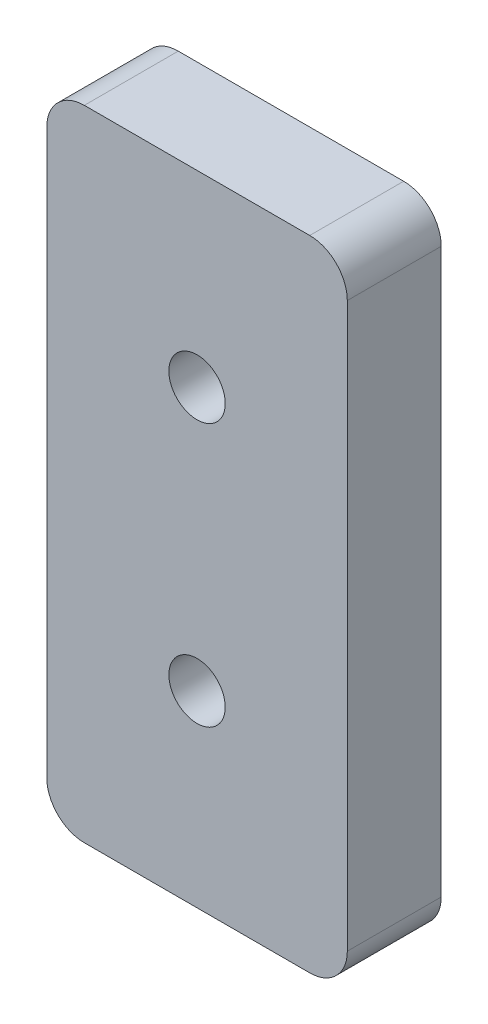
from build123d import *

# Parameters (mm, degrees)
ESQUISSE1_W        = 16
ESQUISSE1_H        = 34
ESQUISSE1_R        = 1.5
BOSS_EXTRU_1_DEPTH = 5
CONG_1_R           = 2


with BuildPart() as part:
    # Esquisse1 → Boss.-Extru.1 (new body)
    with BuildSketch(Plane.XY):
        Rectangle(ESQUISSE1_W, ESQUISSE1_H)
        with Locations((0, -7)):
            Circle(ESQUISSE1_R, mode=Mode.SUBTRACT)
        with Locations((0, 7)):
            Circle(ESQUISSE1_R, mode=Mode.SUBTRACT)
    extrude(amount=BOSS_EXTRU_1_DEPTH)

    # Cong_1
    cong_1_edges = [part.edges().sort_by_distance(p)[0] for p in [
        (-8, 17, 2.5),
        (8, 17, 2.5),
        (8, -17, 2.5),
        (-8, -17, 2.5),
    ]]
    fillet(cong_1_edges, radius=CONG_1_R)


solid = part.part
